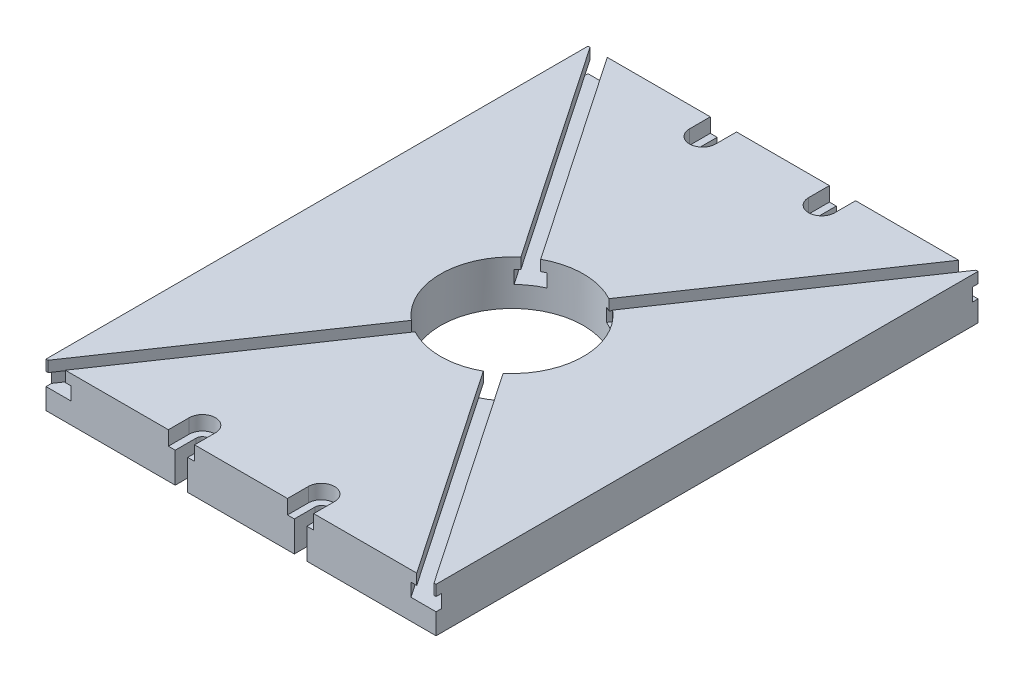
from build123d import *

# Parameters (mm, degrees)
ESQUISSE1_W             = 655
ESQUISSE1_H             = 910
BOSS_EXTRU_1_DEPTH      = 75
ENL_V_MAT_EXTRU_1_REACH = 567.603
ENL_V_MAT_EXTRU_2_DEPTH = 24
ENL_V_MAT_EXTRU_3_DEPTH = 18
ENL_V_MAT_EXTRU_4_DEPTH = 22
ENL_V_MAT_EXTRU_5_REACH = 567.603
ESQUISSE6_R             = 120


with BuildPart() as part:
    # Esquisse1 → Boss.-Extru.1 (new body)
    with BuildSketch(Plane(origin=(0, 0, 0), x_dir=(1, 0, 0), z_dir=(0, 1, 0))):
        Rectangle(ESQUISSE1_W, ESQUISSE1_H)
    extrude(amount=BOSS_EXTRU_1_DEPTH)

    # Esquisse2 → Enl_v. mat.-Extru.1 (cut, up to next)
    with BuildSketch(Plane(origin=(0, 75, 0), x_dir=(1, 0, 0), z_dir=(0, 1, 0)), mode=Mode.PRIVATE) as enl_v_mat_extru_1_sk1:
        with BuildLine():
            Line((89.5, -490), (89.5, -420))
            ThreePointArc((89.5, -420), (100, -409.5), (110.5, -420))
            Line((110.5, -420), (110.5, -490))
            ThreePointArc((110.5, -490), (100, -500.5), (89.5, -490))
        make_face()
    enl_v_mat_extru_1_tool1 = extrude(enl_v_mat_extru_1_sk1.sketch, amount=-ENL_V_MAT_EXTRU_1_REACH, mode=Mode.PRIVATE) & part.part
    # Esquisse2 → Enl_v. mat.-Extru.1 (cut, up to next)
    with BuildSketch(Plane(origin=(0, 75, 0), x_dir=(1, 0, 0), z_dir=(0, 1, 0)), mode=Mode.PRIVATE) as enl_v_mat_extru_1_sk2:
        with BuildLine():
            Line((89.5, 490), (89.5, 420))
            ThreePointArc((89.5, 420), (100, 409.5), (110.5, 420))
            Line((110.5, 420), (110.5, 490))
            ThreePointArc((110.5, 490), (100, 500.5), (89.5, 490))
        make_face()
    enl_v_mat_extru_1_tool2 = extrude(enl_v_mat_extru_1_sk2.sketch, amount=-ENL_V_MAT_EXTRU_1_REACH, mode=Mode.PRIVATE) & part.part
    # Esquisse2 → Enl_v. mat.-Extru.1 (cut, up to next)
    with BuildSketch(Plane(origin=(0, 75, 0), x_dir=(1, 0, 0), z_dir=(0, 1, 0)), mode=Mode.PRIVATE) as enl_v_mat_extru_1_sk3:
        with BuildLine():
            Line((-89.5, 490), (-89.5, 420))
            ThreePointArc((-89.5, 420), (-100, 409.5), (-110.5, 420))
            Line((-110.5, 420), (-110.5, 490))
            ThreePointArc((-110.5, 490), (-100, 500.5), (-89.5, 490))
        make_face()
    enl_v_mat_extru_1_tool3 = extrude(enl_v_mat_extru_1_sk3.sketch, amount=-ENL_V_MAT_EXTRU_1_REACH, mode=Mode.PRIVATE) & part.part
    # Esquisse2 → Enl_v. mat.-Extru.1 (cut, up to next)
    with BuildSketch(Plane(origin=(0, 75, 0), x_dir=(1, 0, 0), z_dir=(0, 1, 0)), mode=Mode.PRIVATE) as enl_v_mat_extru_1_sk4:
        with BuildLine():
            Line((-89.5, -490), (-89.5, -420))
            ThreePointArc((-89.5, -420), (-100, -409.5), (-110.5, -420))
            Line((-110.5, -420), (-110.5, -490))
            ThreePointArc((-110.5, -490), (-100, -500.5), (-89.5, -490))
        make_face()
    enl_v_mat_extru_1_tool4 = extrude(enl_v_mat_extru_1_sk4.sketch, amount=-ENL_V_MAT_EXTRU_1_REACH, mode=Mode.PRIVATE) & part.part
    add(enl_v_mat_extru_1_tool1.solids().sort_by_distance((100, 75, 455))[0], mode=Mode.SUBTRACT)
    add(enl_v_mat_extru_1_tool2.solids().sort_by_distance((100, 75, -455))[0], mode=Mode.SUBTRACT)
    add(enl_v_mat_extru_1_tool3.solids().sort_by_distance((-100, 75, -455))[0], mode=Mode.SUBTRACT)
    add(enl_v_mat_extru_1_tool4.solids().sort_by_distance((-100, 75, 455))[0], mode=Mode.SUBTRACT)

    # Esquisse3 → Enl_v. mat.-Extru.2 (cut)
    with BuildSketch(Plane(origin=(0, 75, 0), x_dir=(1, 0, 0), z_dir=(0, 1, 0))):
        with BuildLine():
            Line((78, -490), (78, -420))
            ThreePointArc((78, -420), (100, -398), (122, -420))
            Line((122, -420), (122, -490))
            ThreePointArc((122, -490), (100, -512), (78, -490))
        make_face()
        with BuildLine():
            Line((78, 490), (78, 420))
            ThreePointArc((78, 420), (100, 398), (122, 420))
            Line((122, 420), (122, 490))
            ThreePointArc((122, 490), (100, 512), (78, 490))
        make_face()
        with BuildLine():
            Line((-78, 490), (-78, 420))
            ThreePointArc((-78, 420), (-100, 398), (-122, 420))
            Line((-122, 420), (-122, 490))
            ThreePointArc((-122, 490), (-100, 512), (-78, 490))
        make_face()
        with BuildLine():
            Line((-78, -490), (-78, -420))
            ThreePointArc((-78, -420), (-100, -398), (-122, -420))
            Line((-122, -420), (-122, -490))
            ThreePointArc((-122, -490), (-100, -512), (-78, -490))
        make_face()
    extrude(amount=-ENL_V_MAT_EXTRU_2_DEPTH, mode=Mode.SUBTRACT)

    # Esquisse4 → Enl_v. mat.-Extru.3 (cut)
    with BuildSketch(Plane(origin=(0, 75, 0), x_dir=(1, 0, 0), z_dir=(0, 1, 0))):
        Polygon((-324.026494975, 455), (304.182555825, -468.49881769), (324.026494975, -455), (-304.182555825, 468.49881769), align=None)
    enl_v_mat_extru_3 = extrude(amount=-ENL_V_MAT_EXTRU_3_DEPTH, mode=Mode.SUBTRACT)

    # Esquisse5 → Enl_v. mat.-Extru.4 (cut)
    with BuildSketch(Plane(origin=(0, 57, 0), x_dir=(1, 0, 0), z_dir=(0, 1, 0))):
        Polygon((-300.628761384, 477.498029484), (333.7019933, -455), (300.628761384, -477.498029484), (-333.7019933, 455), align=None)
    enl_v_mat_extru_4 = extrude(amount=-ENL_V_MAT_EXTRU_4_DEPTH, mode=Mode.SUBTRACT)

    # Sym_trie1: Enl_v. mat.-Extru.3, Enl_v. mat.-Extru.4 across plane
    add(enl_v_mat_extru_3.mirror(Plane(origin=(0, 0, 0), x_dir=(0, 0, 1), z_dir=(1, 0, 0))), mode=Mode.SUBTRACT)
    add(enl_v_mat_extru_4.mirror(Plane(origin=(0, 0, 0), x_dir=(0, 0, 1), z_dir=(1, 0, 0))), mode=Mode.SUBTRACT)

    # Esquisse6 → Enl_v. mat.-Extru.5 (cut, up to next)
    with BuildSketch(Plane(origin=(0, 75, 0), x_dir=(1, 0, 0), z_dir=(0, 1, 0)), mode=Mode.PRIVATE) as enl_v_mat_extru_5_sk1:
        with Locations(Location((0, 0, 0), (0, 0, 270))):
            Circle(ESQUISSE6_R)
    enl_v_mat_extru_5_tool1 = extrude(enl_v_mat_extru_5_sk1.sketch, amount=-ENL_V_MAT_EXTRU_5_REACH, mode=Mode.PRIVATE) & part.part
    add(enl_v_mat_extru_5_tool1.solids().sort_by_distance((0, 75, 0))[0], mode=Mode.SUBTRACT)


solid = part.part
